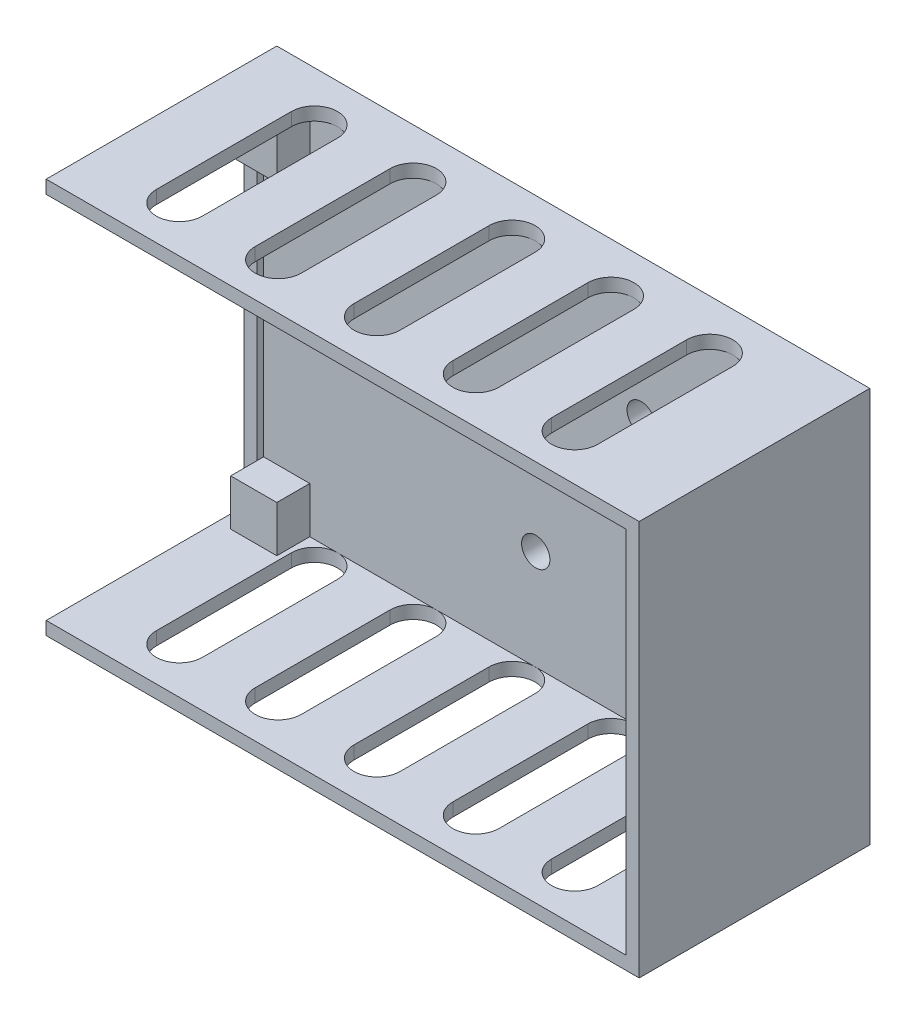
from build123d import *

# Parameters (mm, degrees)
ESQUISSE1_W             = 90
ESQUISSE1_H             = 60
BOSS_EXTRU_1_DEPTH      = 35
ESQUISSE2_W             = 86
ESQUISSE2_H             = 56
ENL_V_MAT_EXTRU_1_DEPTH = 31
ENL_V_MAT_EXTRU_2_DEPTH = 114.688170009
ESQUISSE4_W             = 30
ESQUISSE4_H             = 56
ENL_V_MAT_EXTRU_3_DEPTH = 3
ESQUISSE5_R             = 2.15
ENL_V_MAT_EXTRU_4_DEPTH = 114.688170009
ESQUISSE7_W             = 7
ESQUISSE7_H             = 7
ESQUISSE7_W_2           = 5
BOSS_EXTRU_2_DEPTH      = 5


with BuildPart() as part:
    # Esquisse1 → Boss.-Extru.1 (new body)
    with BuildSketch(Plane.XY):
        with Locations((45, -30)):
            Rectangle(ESQUISSE1_W, ESQUISSE1_H)
    extrude(amount=BOSS_EXTRU_1_DEPTH)

    # Esquisse2 → Enl_v. mat.-Extru.1 (cut)
    with BuildSketch(Plane.XY.offset(35)):
        with Locations((45, -30)):
            Rectangle(ESQUISSE2_W, ESQUISSE2_H)
    extrude(amount=-ENL_V_MAT_EXTRU_1_DEPTH, mode=Mode.SUBTRACT)

    # Esquisse3 → Enl_v. mat.-Extru.2 (cut, through all)
    with BuildSketch(Plane(origin=(0, 0, 0), x_dir=(1, 0, 0), z_dir=(0, 1, 0))):
        with BuildLine():
            Line((16.710480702, -7.5), (16.710480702, -28))
            ThreePointArc((16.710480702, -28), (13.210480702, -31.5), (9.710480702, -28))
            Line((9.710480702, -28), (9.710480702, -7.5))
            ThreePointArc((9.710480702, -7.5), (13.210480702, -4), (16.710480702, -7.5))
        make_face()
        with BuildLine():
            Line((24.710480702, -7.5), (24.710480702, -28))
            ThreePointArc((24.710480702, -28), (28.210480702, -31.5), (31.710480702, -28))
            Line((31.710480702, -28), (31.710480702, -7.5))
            ThreePointArc((31.710480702, -7.5), (28.210480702, -4), (24.710480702, -7.5))
        make_face()
        with BuildLine():
            Line((39.710480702, -7.5), (39.710480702, -28))
            ThreePointArc((39.710480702, -28), (43.210480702, -31.5), (46.710480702, -28))
            Line((46.710480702, -28), (46.710480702, -7.5))
            ThreePointArc((46.710480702, -7.5), (43.210480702, -4), (39.710480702, -7.5))
        make_face()
        with BuildLine():
            Line((54.710480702, -7.5), (54.710480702, -28))
            ThreePointArc((54.710480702, -28), (58.210480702, -31.5), (61.710480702, -28))
            Line((61.710480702, -28), (61.710480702, -7.5))
            ThreePointArc((61.710480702, -7.5), (58.210480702, -4), (54.710480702, -7.5))
        make_face()
        with BuildLine():
            Line((69.710480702, -7.5), (69.710480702, -28))
            ThreePointArc((69.710480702, -28), (73.210480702, -31.5), (76.710480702, -28))
            Line((76.710480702, -28), (76.710480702, -7.5))
            ThreePointArc((76.710480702, -7.5), (73.210480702, -4), (69.710480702, -7.5))
        make_face()
    extrude(amount=-ENL_V_MAT_EXTRU_2_DEPTH, mode=Mode.SUBTRACT)

    # Esquisse4 → Enl_v. mat.-Extru.3 (cut)
    with BuildSketch(Plane.ZY):
        with Locations((20, -30)):
            Rectangle(ESQUISSE4_W, ESQUISSE4_H)
    extrude(amount=-ENL_V_MAT_EXTRU_3_DEPTH, mode=Mode.SUBTRACT)

    # Esquisse5 → Enl_v. mat.-Extru.4 (cut, through all)
    with BuildSketch(Plane(origin=(0, 0, 0), x_dir=(-1, 0, 0), z_dir=(0, 0, -1))):
        with Locations((-43.3, -42.8)):
            Circle(ESQUISSE5_R)
        with Locations((-59.3, -17.23)):
            Circle(ESQUISSE5_R)
    extrude(amount=-ENL_V_MAT_EXTRU_4_DEPTH, mode=Mode.SUBTRACT)

    # Esquisse7 → Boss.-Extru.2 (add)
    with BuildSketch(Plane.XY.offset(4)):
        with Locations((5.5, -5.5)):
            Rectangle(ESQUISSE7_W, ESQUISSE7_H)
        with Locations((5.5, -54.5)):
            Rectangle(ESQUISSE7_W, ESQUISSE7_H)
        with Locations((84.5, -54.5)):
            Rectangle(ESQUISSE7_W, ESQUISSE7_H)
        with Locations((85.5, -5.5)):
            Rectangle(ESQUISSE7_W_2, ESQUISSE7_H)
    extrude(amount=BOSS_EXTRU_2_DEPTH)


solid = part.part
